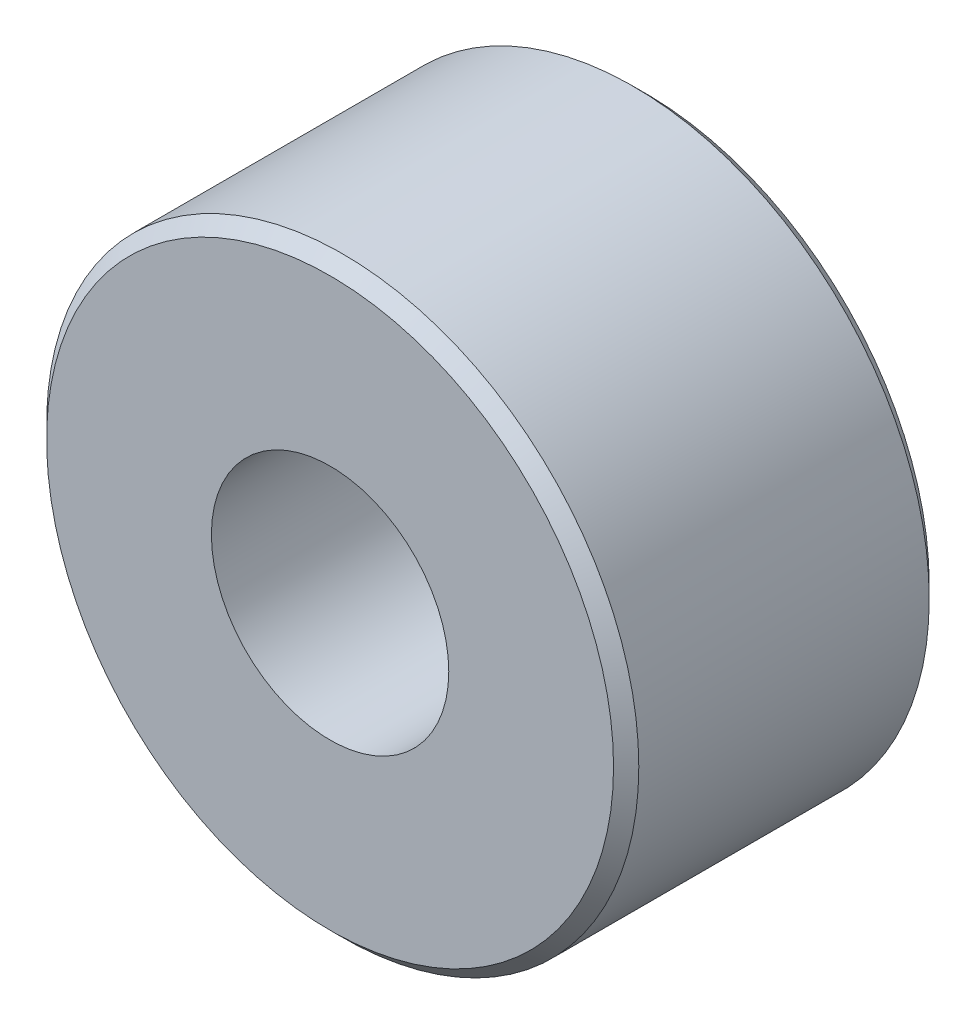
from build123d import *

# Parameters (mm, degrees)
SKETCH1_R           = 5.9563
BOSS_EXTRUDE1_DEPTH = 3.175
SKETCH2_R           = 2.3876
CUT_EXTRUDE1_DEPTH  = 11.548816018
CHAMFER1_SIZE       = 0.254


with BuildPart() as part:
    # Sketch1 → Boss-Extrude1 (new, symmetric)
    with BuildSketch(Plane.XY):
        Circle(SKETCH1_R)
    extrude(amount=BOSS_EXTRUDE1_DEPTH, both=True)

    # Sketch2 → Cut-Extrude1 (cut, through all)
    with BuildSketch(Plane.XY.offset(3.175)):
        Circle(SKETCH2_R)
    extrude(amount=-CUT_EXTRUDE1_DEPTH, mode=Mode.SUBTRACT)

    # Chamfer1
    chamfer1_edges = [part.edges().sort_by_distance(p)[0] for p in [
        (-5.9563, 0, -3.175),
        (-5.9563, 0, 3.175),
    ]]
    chamfer(chamfer1_edges, length=CHAMFER1_SIZE)


solid = part.part
